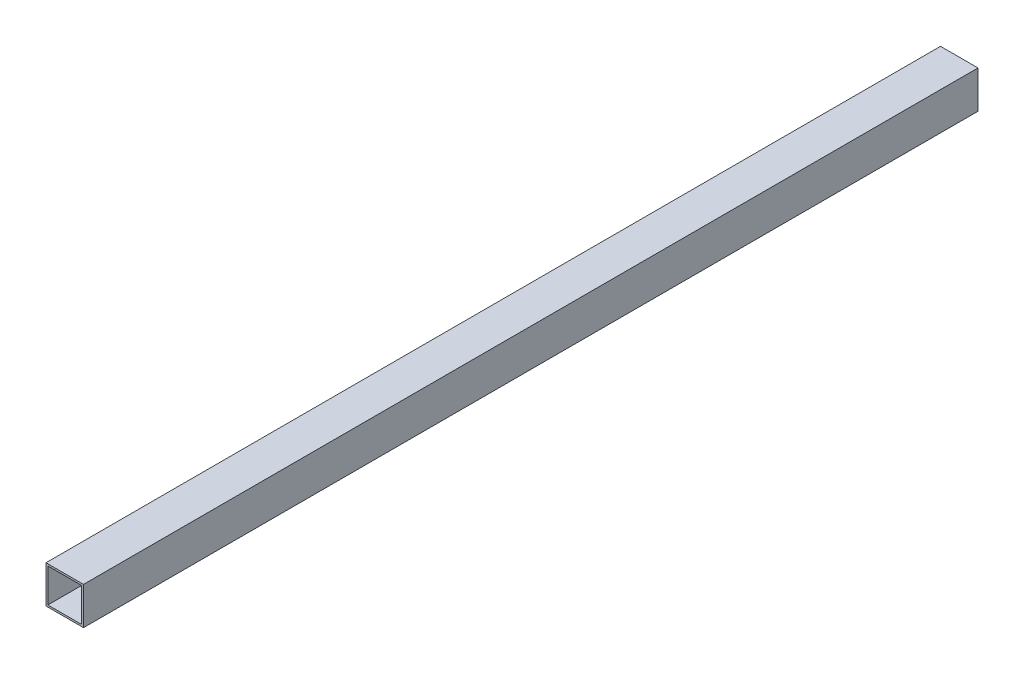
ISO-10303-21;
HEADER;
FILE_DESCRIPTION(('STEP AP214'),'2;1');
FILE_NAME('part.step','',(''),(''),'','','');
FILE_SCHEMA(('AUTOMOTIVE_DESIGN { 1 0 10303 214 1 1 1 1 }'));
ENDSEC;
DATA;
#1=APPLICATION_CONTEXT('core data for automotive mechanical design processes');
#2=APPLICATION_PROTOCOL_DEFINITION('international standard','automotive_design',2000,#1);
#3=PRODUCT_CONTEXT('',#1,'mechanical');
#4=PRODUCT('Part','Part','',(#3));
#5=PRODUCT_RELATED_PRODUCT_CATEGORY('part','',(#4));
#6=PRODUCT_DEFINITION_FORMATION('','',#4);
#7=PRODUCT_DEFINITION_CONTEXT('part definition',#1,'design');
#8=PRODUCT_DEFINITION('design','',#6,#7);
#9=PRODUCT_DEFINITION_SHAPE('','',#8);
#10=(LENGTH_UNIT() NAMED_UNIT(*) SI_UNIT(.MILLI.,.METRE.));
#11=(NAMED_UNIT(*) PLANE_ANGLE_UNIT() SI_UNIT($,.RADIAN.));
#12=(NAMED_UNIT(*) SI_UNIT($,.STERADIAN.) SOLID_ANGLE_UNIT());
#13=UNCERTAINTY_MEASURE_WITH_UNIT(LENGTH_MEASURE(1.E-05),#10,'distance_accuracy_value','');
#14=(GEOMETRIC_REPRESENTATION_CONTEXT(3) GLOBAL_UNCERTAINTY_ASSIGNED_CONTEXT((#13)) GLOBAL_UNIT_ASSIGNED_CONTEXT((#10,
#11,#12)) REPRESENTATION_CONTEXT('',''));
#15=CARTESIAN_POINT('',(0.,0.,0.));
#16=DIRECTION('',(0.,0.,1.));
#17=DIRECTION('',(1.,0.,0.));
#18=AXIS2_PLACEMENT_3D('',#15,#16,#17);
#19=CARTESIAN_POINT('',(0.,0.,1908.));
#20=DIRECTION('',(0.,0.,1.));
#21=DIRECTION('',(1.,0.,0.));
#22=AXIS2_PLACEMENT_3D('',#19,#20,#21);
#23=PLANE('',#22);
#24=DIRECTION('',(0.,-1.,0.));
#25=VECTOR('',#24,1.);
#26=CARTESIAN_POINT('',(-36.,36.,1908.));
#27=LINE('',#26,#25);
#28=CARTESIAN_POINT('',(-36.,36.,1908.));
#29=VERTEX_POINT('',#28);
#30=CARTESIAN_POINT('',(-36.,-36.,1908.));
#31=VERTEX_POINT('',#30);
#32=EDGE_CURVE('E25',#29,#31,#27,.T.);
#33=ORIENTED_EDGE('',*,*,#32,.F.);
#34=DIRECTION('',(-1.,0.,0.));
#35=VECTOR('',#34,1.);
#36=CARTESIAN_POINT('',(36.,36.,1908.));
#37=LINE('',#36,#35);
#38=CARTESIAN_POINT('',(36.,36.,1908.));
#39=VERTEX_POINT('',#38);
#40=EDGE_CURVE('E99',#39,#29,#37,.T.);
#41=ORIENTED_EDGE('',*,*,#40,.F.);
#42=DIRECTION('',(0.,1.,0.));
#43=VECTOR('',#42,1.);
#44=CARTESIAN_POINT('',(36.,-36.,1908.));
#45=LINE('',#44,#43);
#46=CARTESIAN_POINT('',(36.,-36.,1908.));
#47=VERTEX_POINT('',#46);
#48=EDGE_CURVE('E103',#47,#39,#45,.T.);
#49=ORIENTED_EDGE('',*,*,#48,.F.);
#50=DIRECTION('',(1.,0.,0.));
#51=VECTOR('',#50,1.);
#52=CARTESIAN_POINT('',(-36.,-36.,1908.));
#53=LINE('',#52,#51);
#54=EDGE_CURVE('E151',#31,#47,#53,.T.);
#55=ORIENTED_EDGE('',*,*,#54,.F.);
#56=EDGE_LOOP('',(#33,#41,#49,#55));
#57=FACE_BOUND('',#56,.T.);
#58=DIRECTION('',(1.,0.,0.));
#59=VECTOR('',#58,1.);
#60=CARTESIAN_POINT('',(-40.,-40.,1908.));
#61=LINE('',#60,#59);
#62=CARTESIAN_POINT('',(-40.,-40.,1908.));
#63=VERTEX_POINT('',#62);
#64=CARTESIAN_POINT('',(40.,-40.,1908.));
#65=VERTEX_POINT('',#64);
#66=EDGE_CURVE('E153',#63,#65,#61,.T.);
#67=ORIENTED_EDGE('',*,*,#66,.T.);
#68=DIRECTION('',(0.,1.,0.));
#69=VECTOR('',#68,1.);
#70=CARTESIAN_POINT('',(40.,-40.,1908.));
#71=LINE('',#70,#69);
#72=CARTESIAN_POINT('',(40.,40.,1908.));
#73=VERTEX_POINT('',#72);
#74=EDGE_CURVE('E172',#65,#73,#71,.T.);
#75=ORIENTED_EDGE('',*,*,#74,.T.);
#76=DIRECTION('',(-1.,0.,0.));
#77=VECTOR('',#76,1.);
#78=CARTESIAN_POINT('',(40.,40.,1908.));
#79=LINE('',#78,#77);
#80=CARTESIAN_POINT('',(-40.,40.,1908.));
#81=VERTEX_POINT('',#80);
#82=EDGE_CURVE('E162',#73,#81,#79,.T.);
#83=ORIENTED_EDGE('',*,*,#82,.T.);
#84=DIRECTION('',(0.,-1.,0.));
#85=VECTOR('',#84,1.);
#86=CARTESIAN_POINT('',(-40.,40.,1908.));
#87=LINE('',#86,#85);
#88=EDGE_CURVE('E152',#81,#63,#87,.T.);
#89=ORIENTED_EDGE('',*,*,#88,.T.);
#90=EDGE_LOOP('',(#67,#75,#83,#89));
#91=FACE_BOUND('',#90,.T.);
#92=ADVANCED_FACE('F16',(#57,#91),#23,.T.);
#93=CARTESIAN_POINT('',(0.,0.,0.));
#94=DIRECTION('',(0.,0.,1.));
#95=DIRECTION('',(1.,0.,0.));
#96=AXIS2_PLACEMENT_3D('',#93,#94,#95);
#97=PLANE('',#96);
#98=DIRECTION('',(1.,0.,0.));
#99=VECTOR('',#98,1.);
#100=CARTESIAN_POINT('',(-36.,-36.,0.));
#101=LINE('',#100,#99);
#102=CARTESIAN_POINT('',(-36.,-36.,0.));
#103=VERTEX_POINT('',#102);
#104=CARTESIAN_POINT('',(36.,-36.,0.));
#105=VERTEX_POINT('',#104);
#106=EDGE_CURVE('E124',#103,#105,#101,.T.);
#107=ORIENTED_EDGE('',*,*,#106,.T.);
#108=DIRECTION('',(0.,1.,0.));
#109=VECTOR('',#108,1.);
#110=CARTESIAN_POINT('',(36.,-36.,0.));
#111=LINE('',#110,#109);
#112=CARTESIAN_POINT('',(36.,36.,0.));
#113=VERTEX_POINT('',#112);
#114=EDGE_CURVE('E109',#105,#113,#111,.T.);
#115=ORIENTED_EDGE('',*,*,#114,.T.);
#116=DIRECTION('',(-1.,0.,0.));
#117=VECTOR('',#116,1.);
#118=CARTESIAN_POINT('',(36.,36.,0.));
#119=LINE('',#118,#117);
#120=CARTESIAN_POINT('',(-36.,36.,0.));
#121=VERTEX_POINT('',#120);
#122=EDGE_CURVE('E114',#113,#121,#119,.T.);
#123=ORIENTED_EDGE('',*,*,#122,.T.);
#124=DIRECTION('',(0.,-1.,0.));
#125=VECTOR('',#124,1.);
#126=CARTESIAN_POINT('',(-36.,36.,0.));
#127=LINE('',#126,#125);
#128=EDGE_CURVE('E10',#121,#103,#127,.T.);
#129=ORIENTED_EDGE('',*,*,#128,.T.);
#130=EDGE_LOOP('',(#107,#115,#123,#129));
#131=FACE_BOUND('',#130,.T.);
#132=DIRECTION('',(0.,-1.,0.));
#133=VECTOR('',#132,1.);
#134=CARTESIAN_POINT('',(-40.,40.,0.));
#135=LINE('',#134,#133);
#136=CARTESIAN_POINT('',(-40.,40.,0.));
#137=VERTEX_POINT('',#136);
#138=CARTESIAN_POINT('',(-40.,-40.,0.));
#139=VERTEX_POINT('',#138);
#140=EDGE_CURVE('E179',#137,#139,#135,.T.);
#141=ORIENTED_EDGE('',*,*,#140,.F.);
#142=DIRECTION('',(-1.,0.,0.));
#143=VECTOR('',#142,1.);
#144=CARTESIAN_POINT('',(40.,40.,0.));
#145=LINE('',#144,#143);
#146=CARTESIAN_POINT('',(40.,40.,0.));
#147=VERTEX_POINT('',#146);
#148=EDGE_CURVE('E163',#147,#137,#145,.T.);
#149=ORIENTED_EDGE('',*,*,#148,.F.);
#150=DIRECTION('',(0.,1.,0.));
#151=VECTOR('',#150,1.);
#152=CARTESIAN_POINT('',(40.,-40.,0.));
#153=LINE('',#152,#151);
#154=CARTESIAN_POINT('',(40.,-40.,0.));
#155=VERTEX_POINT('',#154);
#156=EDGE_CURVE('E167',#155,#147,#153,.T.);
#157=ORIENTED_EDGE('',*,*,#156,.F.);
#158=DIRECTION('',(1.,0.,0.));
#159=VECTOR('',#158,1.);
#160=CARTESIAN_POINT('',(-40.,-40.,0.));
#161=LINE('',#160,#159);
#162=EDGE_CURVE('E291',#139,#155,#161,.T.);
#163=ORIENTED_EDGE('',*,*,#162,.F.);
#164=EDGE_LOOP('',(#141,#149,#157,#163));
#165=FACE_BOUND('',#164,.T.);
#166=ADVANCED_FACE('F195',(#131,#165),#97,.F.);
#167=CARTESIAN_POINT('',(-36.,36.,0.));
#168=DIRECTION('',(1.,0.,0.));
#169=DIRECTION('',(0.,1.,0.));
#170=AXIS2_PLACEMENT_3D('',#167,#168,#169);
#171=PLANE('',#170);
#172=DIRECTION('',(0.,0.,1.));
#173=VECTOR('',#172,1.);
#174=CARTESIAN_POINT('',(-36.,36.,0.));
#175=LINE('',#174,#173);
#176=EDGE_CURVE('E108',#121,#29,#175,.T.);
#177=ORIENTED_EDGE('',*,*,#176,.T.);
#178=ORIENTED_EDGE('',*,*,#32,.T.);
#179=DIRECTION('',(0.,0.,1.));
#180=VECTOR('',#179,1.);
#181=CARTESIAN_POINT('',(-36.,-36.,0.));
#182=LINE('',#181,#180);
#183=EDGE_CURVE('E148',#103,#31,#182,.T.);
#184=ORIENTED_EDGE('',*,*,#183,.F.);
#185=ORIENTED_EDGE('',*,*,#128,.F.);
#186=EDGE_LOOP('',(#177,#178,#184,#185));
#187=FACE_BOUND('',#186,.T.);
#188=ADVANCED_FACE('F18',(#187),#171,.T.);
#189=CARTESIAN_POINT('',(36.,36.,0.));
#190=DIRECTION('',(0.,-1.,0.));
#191=DIRECTION('',(0.,0.,-1.));
#192=AXIS2_PLACEMENT_3D('',#189,#190,#191);
#193=PLANE('',#192);
#194=DIRECTION('',(0.,0.,1.));
#195=VECTOR('',#194,1.);
#196=CARTESIAN_POINT('',(36.,36.,0.));
#197=LINE('',#196,#195);
#198=EDGE_CURVE('E112',#113,#39,#197,.T.);
#199=ORIENTED_EDGE('',*,*,#198,.T.);
#200=ORIENTED_EDGE('',*,*,#40,.T.);
#201=ORIENTED_EDGE('',*,*,#176,.F.);
#202=ORIENTED_EDGE('',*,*,#122,.F.);
#203=EDGE_LOOP('',(#199,#200,#201,#202));
#204=FACE_BOUND('',#203,.T.);
#205=ADVANCED_FACE('F113',(#204),#193,.T.);
#206=CARTESIAN_POINT('',(36.,-36.,0.));
#207=DIRECTION('',(-1.,0.,0.));
#208=DIRECTION('',(0.,0.,1.));
#209=AXIS2_PLACEMENT_3D('',#206,#207,#208);
#210=PLANE('',#209);
#211=DIRECTION('',(0.,0.,1.));
#212=VECTOR('',#211,1.);
#213=CARTESIAN_POINT('',(36.,-36.,0.));
#214=LINE('',#213,#212);
#215=EDGE_CURVE('E121',#105,#47,#214,.T.);
#216=ORIENTED_EDGE('',*,*,#215,.T.);
#217=ORIENTED_EDGE('',*,*,#48,.T.);
#218=ORIENTED_EDGE('',*,*,#198,.F.);
#219=ORIENTED_EDGE('',*,*,#114,.F.);
#220=EDGE_LOOP('',(#216,#217,#218,#219));
#221=FACE_BOUND('',#220,.T.);
#222=ADVANCED_FACE('F119',(#221),#210,.T.);
#223=CARTESIAN_POINT('',(-36.,-36.,0.));
#224=DIRECTION('',(0.,1.,0.));
#225=DIRECTION('',(1.,0.,0.));
#226=AXIS2_PLACEMENT_3D('',#223,#224,#225);
#227=PLANE('',#226);
#228=ORIENTED_EDGE('',*,*,#183,.T.);
#229=ORIENTED_EDGE('',*,*,#54,.T.);
#230=ORIENTED_EDGE('',*,*,#215,.F.);
#231=ORIENTED_EDGE('',*,*,#106,.F.);
#232=EDGE_LOOP('',(#228,#229,#230,#231));
#233=FACE_BOUND('',#232,.T.);
#234=ADVANCED_FACE('F192',(#233),#227,.T.);
#235=CARTESIAN_POINT('',(-40.,40.,0.));
#236=DIRECTION('',(1.,0.,0.));
#237=DIRECTION('',(0.,1.,0.));
#238=AXIS2_PLACEMENT_3D('',#235,#236,#237);
#239=PLANE('',#238);
#240=ORIENTED_EDGE('',*,*,#140,.T.);
#241=DIRECTION('',(0.,0.,1.));
#242=VECTOR('',#241,1.);
#243=CARTESIAN_POINT('',(-40.,-40.,0.));
#244=LINE('',#243,#242);
#245=EDGE_CURVE('E157',#139,#63,#244,.T.);
#246=ORIENTED_EDGE('',*,*,#245,.T.);
#247=ORIENTED_EDGE('',*,*,#88,.F.);
#248=DIRECTION('',(0.,0.,1.));
#249=VECTOR('',#248,1.);
#250=CARTESIAN_POINT('',(-40.,40.,0.));
#251=LINE('',#250,#249);
#252=EDGE_CURVE('E158',#137,#81,#251,.T.);
#253=ORIENTED_EDGE('',*,*,#252,.F.);
#254=EDGE_LOOP('',(#240,#246,#247,#253));
#255=FACE_BOUND('',#254,.T.);
#256=ADVANCED_FACE('F212',(#255),#239,.F.);
#257=CARTESIAN_POINT('',(40.,40.,0.));
#258=DIRECTION('',(0.,-1.,0.));
#259=DIRECTION('',(0.,0.,-1.));
#260=AXIS2_PLACEMENT_3D('',#257,#258,#259);
#261=PLANE('',#260);
#262=ORIENTED_EDGE('',*,*,#148,.T.);
#263=ORIENTED_EDGE('',*,*,#252,.T.);
#264=ORIENTED_EDGE('',*,*,#82,.F.);
#265=DIRECTION('',(0.,0.,1.));
#266=VECTOR('',#265,1.);
#267=CARTESIAN_POINT('',(40.,40.,0.));
#268=LINE('',#267,#266);
#269=EDGE_CURVE('E171',#147,#73,#268,.T.);
#270=ORIENTED_EDGE('',*,*,#269,.F.);
#271=EDGE_LOOP('',(#262,#263,#264,#270));
#272=FACE_BOUND('',#271,.T.);
#273=ADVANCED_FACE('F208',(#272),#261,.F.);
#274=CARTESIAN_POINT('',(40.,-40.,0.));
#275=DIRECTION('',(-1.,0.,0.));
#276=DIRECTION('',(0.,0.,1.));
#277=AXIS2_PLACEMENT_3D('',#274,#275,#276);
#278=PLANE('',#277);
#279=ORIENTED_EDGE('',*,*,#156,.T.);
#280=ORIENTED_EDGE('',*,*,#269,.T.);
#281=ORIENTED_EDGE('',*,*,#74,.F.);
#282=DIRECTION('',(0.,0.,1.));
#283=VECTOR('',#282,1.);
#284=CARTESIAN_POINT('',(40.,-40.,0.));
#285=LINE('',#284,#283);
#286=EDGE_CURVE('E146',#155,#65,#285,.T.);
#287=ORIENTED_EDGE('',*,*,#286,.F.);
#288=EDGE_LOOP('',(#279,#280,#281,#287));
#289=FACE_BOUND('',#288,.T.);
#290=ADVANCED_FACE('F236',(#289),#278,.F.);
#291=CARTESIAN_POINT('',(-40.,-40.,0.));
#292=DIRECTION('',(0.,1.,0.));
#293=DIRECTION('',(1.,0.,0.));
#294=AXIS2_PLACEMENT_3D('',#291,#292,#293);
#295=PLANE('',#294);
#296=ORIENTED_EDGE('',*,*,#162,.T.);
#297=ORIENTED_EDGE('',*,*,#286,.T.);
#298=ORIENTED_EDGE('',*,*,#66,.F.);
#299=ORIENTED_EDGE('',*,*,#245,.F.);
#300=EDGE_LOOP('',(#296,#297,#298,#299));
#301=FACE_BOUND('',#300,.T.);
#302=ADVANCED_FACE('F244',(#301),#295,.F.);
#303=CLOSED_SHELL('',(#92,#166,#188,#205,#222,#234,#256,#273,#290,#302));
#304=MANIFOLD_SOLID_BREP('B1',#303);
#305=ADVANCED_BREP_SHAPE_REPRESENTATION('',(#18,#304),#14);
#306=SHAPE_DEFINITION_REPRESENTATION(#9,#305);
ENDSEC;
END-ISO-10303-21;
